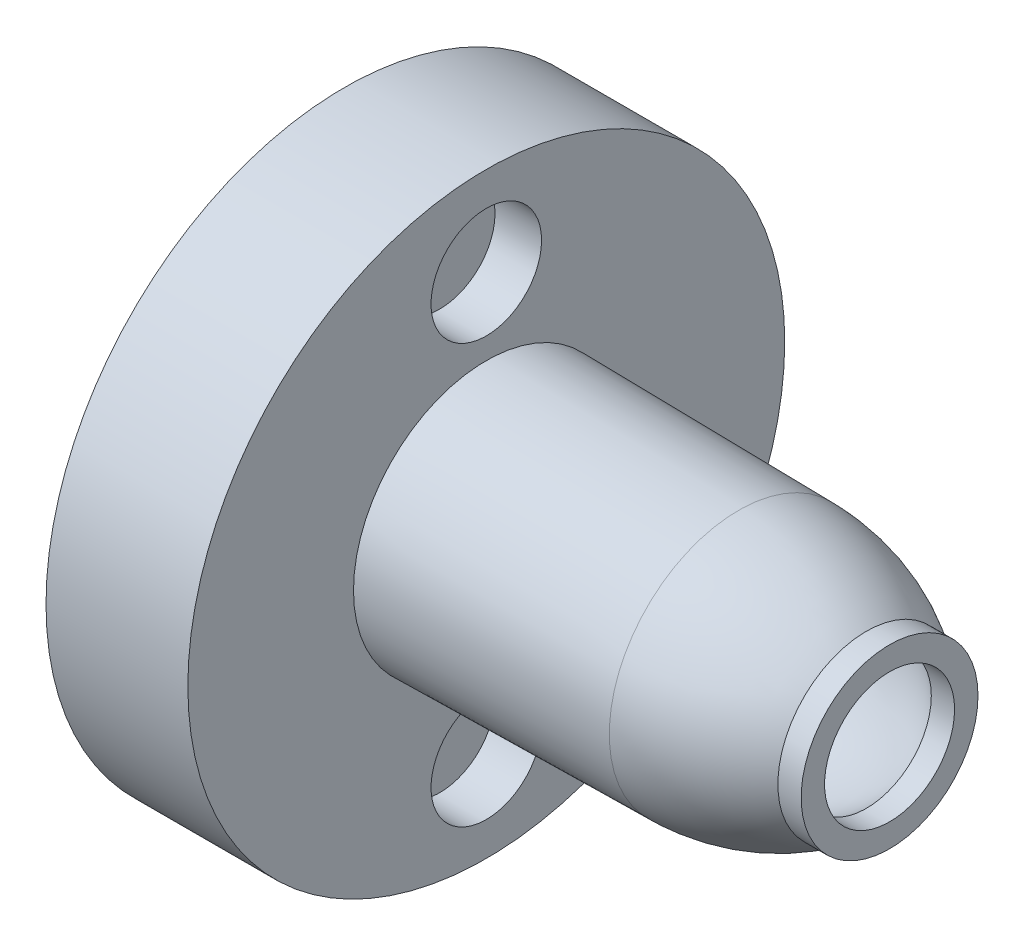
from build123d import *

# Parameters (mm, degrees)
SKETCH5_R          = 2.375
CUT_EXTRUDE1_DEPTH = 2


with BuildPart() as part:
    # Sketch1 → Revolve1 (revolve)
    with BuildSketch(Plane(origin=(0, 0, 0), x_dir=(1, 0, 0), z_dir=(0, 1, 0))):
        with BuildLine():
            Line((-0.999988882, 2.399514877), (1.2251e-05, 2.399514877))
            Line((1.2251e-05, 2.399514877), (1.2251e-05, 1.39309371))
            Line((1.2251e-05, 1.39309371), (-1.000000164, 1.39309371))
            ThreePointArc((-1.000000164, 1.39309371), (-3.600911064, 2.737223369), (-6.486400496, 3.232574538))
            Line((-6.486400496, 3.232574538), (-6.486400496, 4.159218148))
            ThreePointArc((-6.486400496, 4.159218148), (-3.606470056, 3.705647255), (-0.999988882, 2.399514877))
        make_face()
    revolve(axis=Axis((0, 0, 1.40090629), (-1, 0, 0)))

    # Sketch2 → Revolve2 (revolve)
    with BuildSketch(Plane(origin=(0, 0, 0), x_dir=(1, 0, 0), z_dir=(0, 1, 0))):
        Polygon((-6.486400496, 4.159218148), (-17.332200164, 4.30692908), (-17.332200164, 7.10809371), (-17.332200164, 11.42609371), (-23.428200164, 11.42609371), (-23.428200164, 4.26136412), (-23.428200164, 3.590319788), (-6.486400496, 3.359586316), align=None)
    revolve(axis=Axis((8.321799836, 0, 1.40090629), (-1, 0, 0)))

    # Sketch5 → Cut-Extrude1 (cut)
    with BuildSketch(Plane(origin=(-17.332200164, 0, 0), x_dir=(0, 0, -1), z_dir=(1, 0, 0))):
        with Locations((-1.40090629, -9)):
            Circle(SKETCH5_R)
        with Locations((-1.40090629, 9)):
            Circle(SKETCH5_R)
    extrude(amount=-CUT_EXTRUDE1_DEPTH, mode=Mode.SUBTRACT)


solid = part.part
